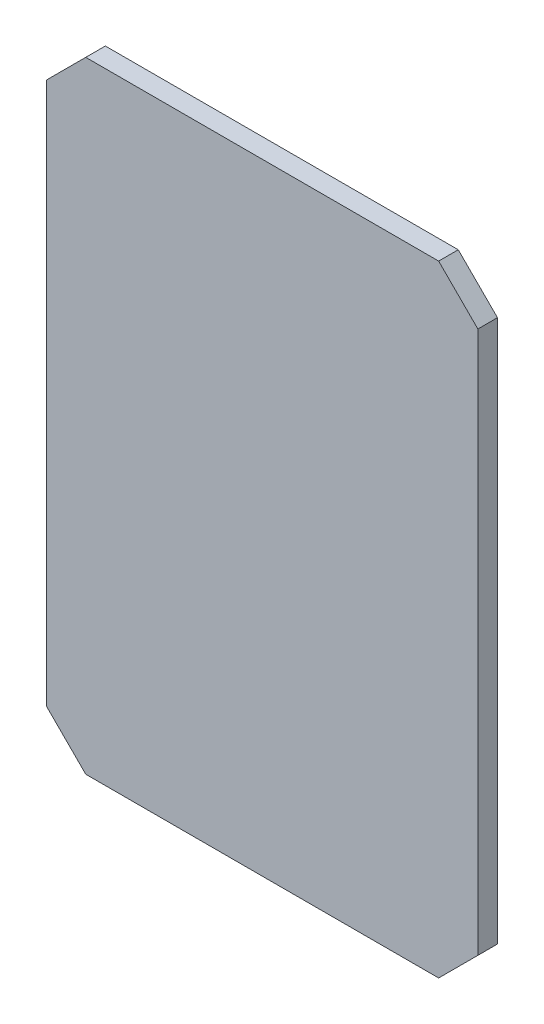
from build123d import *

# Parameters (mm, degrees)
ESQUISSE1_W        = 66
ESQUISSE1_H        = 95
BOSS_EXTRU_1_DEPTH = 3
CHANFREIN1_SIZE    = 6


with BuildPart() as part:
    # Esquisse1 → Boss.-Extru.1 (new body)
    with BuildSketch(Plane.XY):
        Rectangle(ESQUISSE1_W, ESQUISSE1_H)
    extrude(amount=BOSS_EXTRU_1_DEPTH)

    # Chanfrein1
    chanfrein1_edges = [part.edges().sort_by_distance(p)[0] for p in [
        (-33, 47.5, 1.5),
        (33, 47.5, 1.5),
        (33, -47.5, 1.5),
        (-33, -47.5, 1.5),
    ]]
    chamfer(chanfrein1_edges, length=CHANFREIN1_SIZE)


solid = part.part
